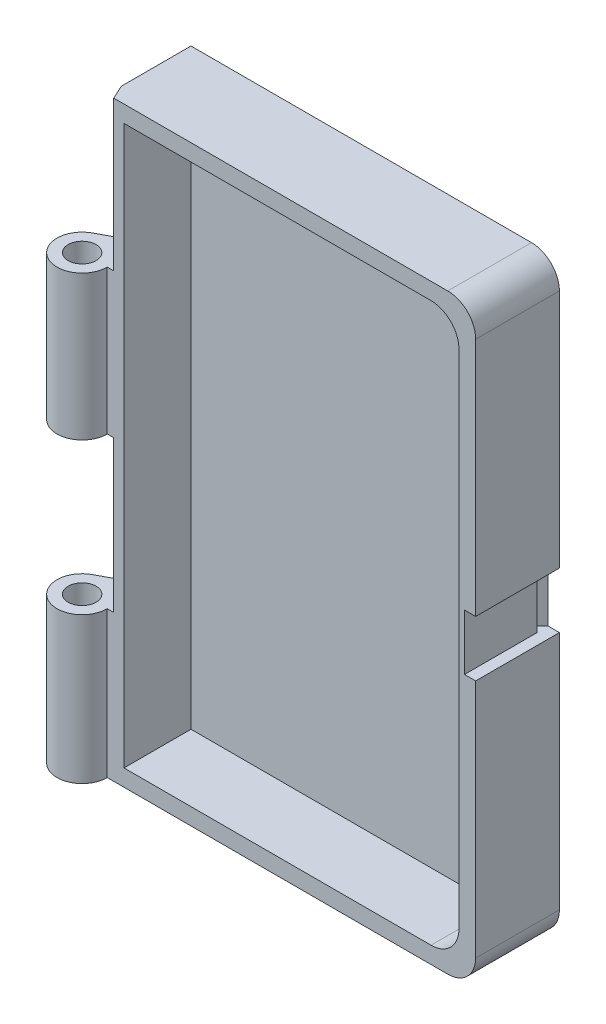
from build123d import *

# Parameters (mm, degrees)
ESQUISSE2_W             = 66
ESQUISSE2_H             = 106
BOSS_EXTRU_2_DEPTH      = 15
COQUE1_T                = -3
ESQUISSE3_R             = 2.5
BOSS_EXTRU_3_DEPTH      = 106
ESQUISSE4_W             = 9
ESQUISSE4_H             = 26.8
ESQUISSE4_H_2           = 27.1
ENL_V_MAT_EXTRU_1_DEPTH = 71.379329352
ENL_V_MAT_EXTRU_3_DEPTH = 5
CONG_1_R                = 5
CHANFREIN1_SIZE         = 2.5
CHANFREIN1_SIZE2        = 1.165769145
CHANFREIN2_SIZE         = 2.5
CHANFREIN2_SIZE2        = 1.165769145


with BuildPart() as part:
    # Esquisse2 → Boss.-Extru.2 (new body)
    with BuildSketch(Plane.XY):
        Rectangle(ESQUISSE2_W, ESQUISSE2_H)
    extrude(amount=BOSS_EXTRU_2_DEPTH)

    # Coque1
    coque1_openings = [part.faces().sort_by_distance(p)[0] for p in [
        (0, 0, 15),
    ]]
    offset(amount=COQUE1_T, openings=coque1_openings, kind=Kind.INTERSECTION)

    # Esquisse3 → Boss.-Extru.3 (add, through all)
    with BuildSketch(Plane.XZ.offset(53)):
        with BuildLine():
            Line((-33, 15), (-33, 7.5))
            Line((-33, 7.5), (-39.617647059, 11.029411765))
            ThreePointArc((-39.617647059, 11.029411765), (-39.815230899, 18.858718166), (-33, 15))
        make_face()
        with Locations(Location((-37.5, 15, 0), (0, 0, 270))):
            Circle(ESQUISSE3_R, mode=Mode.SUBTRACT)
    extrude(amount=-BOSS_EXTRU_3_DEPTH)

    # Esquisse4 → Enl_v. mat.-Extru.1 (cut, through all)
    with BuildSketch(Plane(origin=(0, 0, 0), x_dir=(-1, 0, 0), z_dir=(0, 0, -1))):
        with Locations((37.5, 39.6)):
            Rectangle(ESQUISSE4_W, ESQUISSE4_H)
        with Locations((37.5, -13.25)):
            Rectangle(ESQUISSE4_W, ESQUISSE4_H_2)
    extrude(amount=-ENL_V_MAT_EXTRU_1_DEPTH, mode=Mode.SUBTRACT)

    # Esquisse6 → Enl_v. mat.-Extru.3 (cut, symmetric)
    with BuildSketch(Plane(origin=(0, 0, 0), x_dir=(-1, 0, 0), z_dir=(0, -1, 0))):
        Polygon((-31, 0), (-29, -2), (-31, -2), (-31, -15), (-33, -15), (-33, 0), align=None)
    extrude(amount=ENL_V_MAT_EXTRU_3_DEPTH, both=True, mode=Mode.SUBTRACT)

    # Cong_1
    cong_1_edges = [part.edges().sort_by_distance(p)[0] for p in [
        (30, -50, 9),
        (30, 50, 9),
        (33, 53, 7.5),
        (33, -53, 7.5),
    ]]
    fillet(cong_1_edges, radius=CONG_1_R)

    # Chanfrein1
    chanfrein1_edges = [part.edges().sort_by_distance(p)[0] for p in [
        (-33, -13.25, 15),
    ]]
    chanfrein1_side = [part.faces().sort_by_distance(p)[0] for p in [
        (-33, 4.391525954, 6.278142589),
    ]]
    chamfer(chanfrein1_edges, length=CHANFREIN1_SIZE, length2=CHANFREIN1_SIZE2, reference=chanfrein1_side[0])

    # Chanfrein2
    chanfrein2_edges = [part.edges().sort_by_distance(p)[0] for p in [
        (-33, 39.6, 15),
    ]]
    chanfrein2_side = [part.faces().sort_by_distance(p)[0] for p in [
        (-33, 5.447834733, 5.830755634),
    ]]
    chamfer(chanfrein2_edges, length=CHANFREIN2_SIZE, length2=CHANFREIN2_SIZE2, reference=chanfrein2_side[0])


solid = part.part
